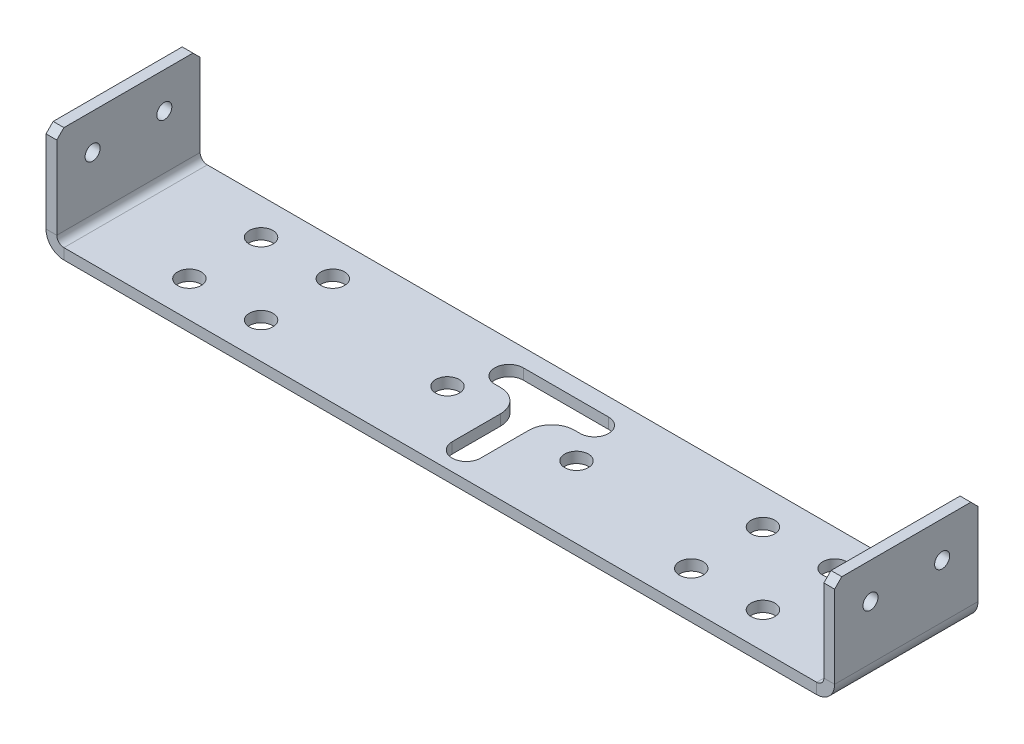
ISO-10303-21;
HEADER;
FILE_DESCRIPTION(('STEP AP214'),'2;1');
FILE_NAME('part.step','',(''),(''),'','','');
FILE_SCHEMA(('AUTOMOTIVE_DESIGN { 1 0 10303 214 1 1 1 1 }'));
ENDSEC;
DATA;
#1=APPLICATION_CONTEXT('core data for automotive mechanical design processes');
#2=APPLICATION_PROTOCOL_DEFINITION('international standard','automotive_design',2000,#1);
#3=PRODUCT_CONTEXT('',#1,'mechanical');
#4=PRODUCT('Part','Part','',(#3));
#5=PRODUCT_RELATED_PRODUCT_CATEGORY('part','',(#4));
#6=PRODUCT_DEFINITION_FORMATION('','',#4);
#7=PRODUCT_DEFINITION_CONTEXT('part definition',#1,'design');
#8=PRODUCT_DEFINITION('design','',#6,#7);
#9=PRODUCT_DEFINITION_SHAPE('','',#8);
#10=(LENGTH_UNIT() NAMED_UNIT(*) SI_UNIT(.MILLI.,.METRE.));
#11=(NAMED_UNIT(*) PLANE_ANGLE_UNIT() SI_UNIT($,.RADIAN.));
#12=(NAMED_UNIT(*) SI_UNIT($,.STERADIAN.) SOLID_ANGLE_UNIT());
#13=UNCERTAINTY_MEASURE_WITH_UNIT(LENGTH_MEASURE(1.E-05),#10,'distance_accuracy_value','');
#14=(GEOMETRIC_REPRESENTATION_CONTEXT(3) GLOBAL_UNCERTAINTY_ASSIGNED_CONTEXT((#13)) GLOBAL_UNIT_ASSIGNED_CONTEXT((#10,
#11,#12)) REPRESENTATION_CONTEXT('',''));
#15=CARTESIAN_POINT('',(0.,0.,0.));
#16=DIRECTION('',(0.,0.,1.));
#17=DIRECTION('',(1.,0.,0.));
#18=AXIS2_PLACEMENT_3D('',#15,#16,#17);
#19=CARTESIAN_POINT('',(-110.,5.,20.));
#20=DIRECTION('',(0.,0.,1.));
#21=DIRECTION('',(1.,0.,0.));
#22=AXIS2_PLACEMENT_3D('',#19,#20,#21);
#23=PLANE('',#22);
#24=DIRECTION('',(1.,0.,0.));
#25=VECTOR('',#24,1.);
#26=CARTESIAN_POINT('',(-110.,5.,20.));
#27=LINE('',#26,#25);
#28=CARTESIAN_POINT('',(-110.,5.,20.));
#29=VERTEX_POINT('',#28);
#30=CARTESIAN_POINT('',(-107.,5.,20.));
#31=VERTEX_POINT('',#30);
#32=EDGE_CURVE('E468',#29,#31,#27,.T.);
#33=ORIENTED_EDGE('',*,*,#32,.F.);
#34=CARTESIAN_POINT('',(-105.,5.,20.));
#35=DIRECTION('',(0.,0.,-1.));
#36=DIRECTION('',(-1.,0.,0.));
#37=AXIS2_PLACEMENT_3D('',#34,#35,#36);
#38=CIRCLE('',#37,5.);
#39=CARTESIAN_POINT('',(-105.,0.,20.));
#40=VERTEX_POINT('',#39);
#41=EDGE_CURVE('E382',#29,#40,#38,.F.);
#42=ORIENTED_EDGE('',*,*,#41,.T.);
#43=DIRECTION('',(0.,-1.,0.));
#44=VECTOR('',#43,1.);
#45=CARTESIAN_POINT('',(-105.,3.,20.));
#46=LINE('',#45,#44);
#47=CARTESIAN_POINT('',(-105.,3.,20.));
#48=VERTEX_POINT('',#47);
#49=EDGE_CURVE('E466',#48,#40,#46,.T.);
#50=ORIENTED_EDGE('',*,*,#49,.F.);
#51=CARTESIAN_POINT('',(-105.,5.,20.));
#52=DIRECTION('',(0.,0.,1.));
#53=DIRECTION('',(1.,0.,0.));
#54=AXIS2_PLACEMENT_3D('',#51,#52,#53);
#55=CIRCLE('',#54,2.);
#56=EDGE_CURVE('E375',#31,#48,#55,.T.);
#57=ORIENTED_EDGE('',*,*,#56,.F.);
#58=EDGE_LOOP('',(#33,#42,#50,#57));
#59=FACE_BOUND('',#58,.T.);
#60=ADVANCED_FACE('F42',(#59),#23,.T.);
#61=CARTESIAN_POINT('',(-105.,3.,20.));
#62=DIRECTION('',(0.,0.,1.));
#63=DIRECTION('',(1.,0.,0.));
#64=AXIS2_PLACEMENT_3D('',#61,#62,#63);
#65=PLANE('',#64);
#66=DIRECTION('',(0.,1.,0.));
#67=VECTOR('',#66,1.);
#68=CARTESIAN_POINT('',(-107.,30.,20.));
#69=LINE('',#68,#67);
#70=CARTESIAN_POINT('',(-107.,28.,20.));
#71=VERTEX_POINT('',#70);
#72=EDGE_CURVE('E378',#71,#31,#69,.F.);
#73=ORIENTED_EDGE('',*,*,#72,.F.);
#74=DIRECTION('',(-1.,0.,0.));
#75=VECTOR('',#74,1.);
#76=CARTESIAN_POINT('',(-105.,28.,20.));
#77=LINE('',#76,#75);
#78=CARTESIAN_POINT('',(-110.,28.,20.));
#79=VERTEX_POINT('',#78);
#80=EDGE_CURVE('E498',#71,#79,#77,.T.);
#81=ORIENTED_EDGE('',*,*,#80,.T.);
#82=DIRECTION('',(0.,-1.,0.));
#83=VECTOR('',#82,1.);
#84=CARTESIAN_POINT('',(-110.,30.,20.));
#85=LINE('',#84,#83);
#86=EDGE_CURVE('E380',#79,#29,#85,.T.);
#87=ORIENTED_EDGE('',*,*,#86,.T.);
#88=ORIENTED_EDGE('',*,*,#32,.T.);
#89=EDGE_LOOP('',(#73,#81,#87,#88));
#90=FACE_BOUND('',#89,.T.);
#91=ADVANCED_FACE('F559',(#90),#65,.T.);
#92=CARTESIAN_POINT('',(-105.,0.,-20.));
#93=DIRECTION('',(0.,0.,-1.));
#94=DIRECTION('',(-1.,0.,0.));
#95=AXIS2_PLACEMENT_3D('',#92,#93,#94);
#96=PLANE('',#95);
#97=DIRECTION('',(0.,1.,0.));
#98=VECTOR('',#97,1.);
#99=CARTESIAN_POINT('',(-105.,0.,-20.));
#100=LINE('',#99,#98);
#101=CARTESIAN_POINT('',(-105.,0.,-20.));
#102=VERTEX_POINT('',#101);
#103=CARTESIAN_POINT('',(-105.,3.,-20.));
#104=VERTEX_POINT('',#103);
#105=EDGE_CURVE('E464',#102,#104,#100,.T.);
#106=ORIENTED_EDGE('',*,*,#105,.F.);
#107=CARTESIAN_POINT('',(-105.,5.,-20.));
#108=DIRECTION('',(0.,0.,-1.));
#109=DIRECTION('',(-1.,0.,0.));
#110=AXIS2_PLACEMENT_3D('',#107,#108,#109);
#111=CIRCLE('',#110,5.);
#112=CARTESIAN_POINT('',(-110.,5.,-20.));
#113=VERTEX_POINT('',#112);
#114=EDGE_CURVE('E410',#113,#102,#111,.F.);
#115=ORIENTED_EDGE('',*,*,#114,.F.);
#116=DIRECTION('',(-1.,0.,0.));
#117=VECTOR('',#116,1.);
#118=CARTESIAN_POINT('',(-107.,5.,-20.));
#119=LINE('',#118,#117);
#120=CARTESIAN_POINT('',(-107.,5.,-20.));
#121=VERTEX_POINT('',#120);
#122=EDGE_CURVE('E461',#121,#113,#119,.T.);
#123=ORIENTED_EDGE('',*,*,#122,.F.);
#124=CARTESIAN_POINT('',(-105.,5.,-20.));
#125=DIRECTION('',(0.,0.,1.));
#126=DIRECTION('',(1.,0.,0.));
#127=AXIS2_PLACEMENT_3D('',#124,#125,#126);
#128=CIRCLE('',#127,2.);
#129=EDGE_CURVE('E403',#121,#104,#128,.T.);
#130=ORIENTED_EDGE('',*,*,#129,.T.);
#131=EDGE_LOOP('',(#106,#115,#123,#130));
#132=FACE_BOUND('',#131,.T.);
#133=ADVANCED_FACE('F565',(#132),#96,.T.);
#134=CARTESIAN_POINT('',(-107.,5.,-20.));
#135=DIRECTION('',(0.,0.,-1.));
#136=DIRECTION('',(-1.,0.,0.));
#137=AXIS2_PLACEMENT_3D('',#134,#135,#136);
#138=PLANE('',#137);
#139=DIRECTION('',(1.,0.,0.));
#140=VECTOR('',#139,1.);
#141=CARTESIAN_POINT('',(-110.,0.,-20.));
#142=LINE('',#141,#140);
#143=CARTESIAN_POINT('',(105.,0.,-20.));
#144=VERTEX_POINT('',#143);
#145=EDGE_CURVE('E413',#102,#144,#142,.T.);
#146=ORIENTED_EDGE('',*,*,#145,.F.);
#147=ORIENTED_EDGE('',*,*,#105,.T.);
#148=DIRECTION('',(1.,0.,0.));
#149=VECTOR('',#148,1.);
#150=CARTESIAN_POINT('',(-110.,3.,-20.));
#151=LINE('',#150,#149);
#152=CARTESIAN_POINT('',(105.,3.00000000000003,-20.));
#153=VERTEX_POINT('',#152);
#154=EDGE_CURVE('E400',#104,#153,#151,.T.);
#155=ORIENTED_EDGE('',*,*,#154,.T.);
#156=DIRECTION('',(0.,-1.,0.));
#157=VECTOR('',#156,1.);
#158=CARTESIAN_POINT('',(105.,3.00000000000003,-20.));
#159=LINE('',#158,#157);
#160=EDGE_CURVE('E453',#153,#144,#159,.T.);
#161=ORIENTED_EDGE('',*,*,#160,.T.);
#162=EDGE_LOOP('',(#146,#147,#155,#161));
#163=FACE_BOUND('',#162,.T.);
#164=ADVANCED_FACE('F615',(#163),#138,.T.);
#165=CARTESIAN_POINT('',(105.,0.,20.));
#166=DIRECTION('',(0.,0.,1.));
#167=DIRECTION('',(1.,0.,0.));
#168=AXIS2_PLACEMENT_3D('',#165,#166,#167);
#169=PLANE('',#168);
#170=DIRECTION('',(0.,1.,0.));
#171=VECTOR('',#170,1.);
#172=CARTESIAN_POINT('',(105.,0.,20.));
#173=LINE('',#172,#171);
#174=CARTESIAN_POINT('',(105.,0.,20.));
#175=VERTEX_POINT('',#174);
#176=CARTESIAN_POINT('',(105.,3.00000000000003,20.));
#177=VERTEX_POINT('',#176);
#178=EDGE_CURVE('E459',#175,#177,#173,.T.);
#179=ORIENTED_EDGE('',*,*,#178,.F.);
#180=CARTESIAN_POINT('',(105.,5.00000000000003,20.));
#181=DIRECTION('',(0.,0.,-1.));
#182=DIRECTION('',(-1.,0.,0.));
#183=AXIS2_PLACEMENT_3D('',#180,#181,#182);
#184=CIRCLE('',#183,5.);
#185=CARTESIAN_POINT('',(110.,5.00000000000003,20.));
#186=VERTEX_POINT('',#185);
#187=EDGE_CURVE('E388',#175,#186,#184,.F.);
#188=ORIENTED_EDGE('',*,*,#187,.T.);
#189=DIRECTION('',(1.,0.,0.));
#190=VECTOR('',#189,1.);
#191=CARTESIAN_POINT('',(107.,5.00000000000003,20.));
#192=LINE('',#191,#190);
#193=CARTESIAN_POINT('',(107.,5.00000000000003,20.));
#194=VERTEX_POINT('',#193);
#195=EDGE_CURVE('E457',#194,#186,#192,.T.);
#196=ORIENTED_EDGE('',*,*,#195,.F.);
#197=CARTESIAN_POINT('',(105.,5.00000000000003,20.));
#198=DIRECTION('',(0.,0.,1.));
#199=DIRECTION('',(1.,0.,0.));
#200=AXIS2_PLACEMENT_3D('',#197,#198,#199);
#201=CIRCLE('',#200,2.);
#202=EDGE_CURVE('E369',#177,#194,#201,.T.);
#203=ORIENTED_EDGE('',*,*,#202,.F.);
#204=EDGE_LOOP('',(#179,#188,#196,#203));
#205=FACE_BOUND('',#204,.T.);
#206=ADVANCED_FACE('F643',(#205),#169,.T.);
#207=CARTESIAN_POINT('',(107.,5.00000000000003,20.));
#208=DIRECTION('',(0.,0.,1.));
#209=DIRECTION('',(1.,0.,0.));
#210=AXIS2_PLACEMENT_3D('',#207,#208,#209);
#211=PLANE('',#210);
#212=DIRECTION('',(1.,0.,0.));
#213=VECTOR('',#212,1.);
#214=CARTESIAN_POINT('',(-110.,0.,20.));
#215=LINE('',#214,#213);
#216=EDGE_CURVE('E385',#40,#175,#215,.T.);
#217=ORIENTED_EDGE('',*,*,#216,.T.);
#218=ORIENTED_EDGE('',*,*,#178,.T.);
#219=DIRECTION('',(1.,0.,0.));
#220=VECTOR('',#219,1.);
#221=CARTESIAN_POINT('',(-110.,3.,20.));
#222=LINE('',#221,#220);
#223=EDGE_CURVE('E372',#48,#177,#222,.T.);
#224=ORIENTED_EDGE('',*,*,#223,.F.);
#225=ORIENTED_EDGE('',*,*,#49,.T.);
#226=EDGE_LOOP('',(#217,#218,#224,#225));
#227=FACE_BOUND('',#226,.T.);
#228=ADVANCED_FACE('F645',(#227),#211,.T.);
#229=CARTESIAN_POINT('',(110.,5.00000000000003,-20.));
#230=DIRECTION('',(0.,0.,-1.));
#231=DIRECTION('',(-1.,0.,0.));
#232=AXIS2_PLACEMENT_3D('',#229,#230,#231);
#233=PLANE('',#232);
#234=DIRECTION('',(-1.,0.,0.));
#235=VECTOR('',#234,1.);
#236=CARTESIAN_POINT('',(110.,5.00000000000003,-20.));
#237=LINE('',#236,#235);
#238=CARTESIAN_POINT('',(110.,5.00000000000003,-20.));
#239=VERTEX_POINT('',#238);
#240=CARTESIAN_POINT('',(107.,5.00000000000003,-20.));
#241=VERTEX_POINT('',#240);
#242=EDGE_CURVE('E455',#239,#241,#237,.T.);
#243=ORIENTED_EDGE('',*,*,#242,.F.);
#244=CARTESIAN_POINT('',(105.,5.00000000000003,-20.));
#245=DIRECTION('',(0.,0.,-1.));
#246=DIRECTION('',(-1.,0.,0.));
#247=AXIS2_PLACEMENT_3D('',#244,#245,#246);
#248=CIRCLE('',#247,5.);
#249=EDGE_CURVE('E366',#144,#239,#248,.F.);
#250=ORIENTED_EDGE('',*,*,#249,.F.);
#251=ORIENTED_EDGE('',*,*,#160,.F.);
#252=CARTESIAN_POINT('',(105.,5.00000000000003,-20.));
#253=DIRECTION('',(0.,0.,1.));
#254=DIRECTION('',(1.,0.,0.));
#255=AXIS2_PLACEMENT_3D('',#252,#253,#254);
#256=CIRCLE('',#255,2.);
#257=EDGE_CURVE('E397',#153,#241,#256,.T.);
#258=ORIENTED_EDGE('',*,*,#257,.T.);
#259=EDGE_LOOP('',(#243,#250,#251,#258));
#260=FACE_BOUND('',#259,.T.);
#261=ADVANCED_FACE('F632',(#260),#233,.T.);
#262=CARTESIAN_POINT('',(105.,3.00000000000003,-20.));
#263=DIRECTION('',(0.,0.,-1.));
#264=DIRECTION('',(-1.,0.,0.));
#265=AXIS2_PLACEMENT_3D('',#262,#263,#264);
#266=PLANE('',#265);
#267=DIRECTION('',(0.,1.,0.));
#268=VECTOR('',#267,1.);
#269=CARTESIAN_POINT('',(107.,0.,-20.));
#270=LINE('',#269,#268);
#271=CARTESIAN_POINT('',(107.,28.,-20.));
#272=VERTEX_POINT('',#271);
#273=EDGE_CURVE('E394',#241,#272,#270,.T.);
#274=ORIENTED_EDGE('',*,*,#273,.T.);
#275=DIRECTION('',(1.,0.,0.));
#276=VECTOR('',#275,1.);
#277=CARTESIAN_POINT('',(105.,28.,-20.));
#278=LINE('',#277,#276);
#279=CARTESIAN_POINT('',(110.,28.,-20.));
#280=VERTEX_POINT('',#279);
#281=EDGE_CURVE('E486',#272,#280,#278,.T.);
#282=ORIENTED_EDGE('',*,*,#281,.T.);
#283=DIRECTION('',(0.,1.,0.));
#284=VECTOR('',#283,1.);
#285=CARTESIAN_POINT('',(110.,0.,-20.));
#286=LINE('',#285,#284);
#287=EDGE_CURVE('E361',#239,#280,#286,.T.);
#288=ORIENTED_EDGE('',*,*,#287,.F.);
#289=ORIENTED_EDGE('',*,*,#242,.T.);
#290=EDGE_LOOP('',(#274,#282,#288,#289));
#291=FACE_BOUND('',#290,.T.);
#292=ADVANCED_FACE('F684',(#291),#266,.T.);
#293=CARTESIAN_POINT('',(110.,0.,20.));
#294=DIRECTION('',(-1.,0.,0.));
#295=DIRECTION('',(0.,-1.,0.));
#296=AXIS2_PLACEMENT_3D('',#293,#294,#295);
#297=PLANE('',#296);
#298=CARTESIAN_POINT('',(110.,20.,-10.));
#299=DIRECTION('',(-1.,0.,0.));
#300=DIRECTION('',(0.,-1.,0.));
#301=AXIS2_PLACEMENT_3D('',#298,#299,#300);
#302=CIRCLE('',#301,2.1);
#303=CARTESIAN_POINT('',(110.,17.9,-10.));
#304=VERTEX_POINT('',#303);
#305=EDGE_CURVE('E354',#304,#304,#302,.T.);
#306=ORIENTED_EDGE('',*,*,#305,.T.);
#307=EDGE_LOOP('',(#306));
#308=FACE_BOUND('',#307,.T.);
#309=CARTESIAN_POINT('',(110.,20.,10.));
#310=DIRECTION('',(-1.,0.,0.));
#311=DIRECTION('',(0.,-1.,0.));
#312=AXIS2_PLACEMENT_3D('',#309,#310,#311);
#313=CIRCLE('',#312,2.1);
#314=CARTESIAN_POINT('',(110.,17.9,10.));
#315=VERTEX_POINT('',#314);
#316=EDGE_CURVE('E358',#315,#315,#313,.T.);
#317=ORIENTED_EDGE('',*,*,#316,.T.);
#318=EDGE_LOOP('',(#317));
#319=FACE_BOUND('',#318,.T.);
#320=DIRECTION('',(0.,0.,-1.));
#321=VECTOR('',#320,1.);
#322=CARTESIAN_POINT('',(110.,30.,20.));
#323=LINE('',#322,#321);
#324=CARTESIAN_POINT('',(110.,30.,18.));
#325=VERTEX_POINT('',#324);
#326=CARTESIAN_POINT('',(110.,30.,-18.));
#327=VERTEX_POINT('',#326);
#328=EDGE_CURVE('E450',#325,#327,#323,.T.);
#329=ORIENTED_EDGE('',*,*,#328,.F.);
#330=DIRECTION('',(0.,0.707106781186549,-0.707106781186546));
#331=VECTOR('',#330,1.);
#332=CARTESIAN_POINT('',(110.,30.,18.));
#333=LINE('',#332,#331);
#334=CARTESIAN_POINT('',(110.,28.,20.));
#335=VERTEX_POINT('',#334);
#336=EDGE_CURVE('E478',#325,#335,#333,.F.);
#337=ORIENTED_EDGE('',*,*,#336,.T.);
#338=DIRECTION('',(0.,1.,0.));
#339=VECTOR('',#338,1.);
#340=CARTESIAN_POINT('',(110.,0.,20.));
#341=LINE('',#340,#339);
#342=EDGE_CURVE('E362',#186,#335,#341,.T.);
#343=ORIENTED_EDGE('',*,*,#342,.F.);
#344=DIRECTION('',(0.,0.,-1.));
#345=VECTOR('',#344,1.);
#346=CARTESIAN_POINT('',(110.,5.00000000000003,20.));
#347=LINE('',#346,#345);
#348=EDGE_CURVE('E391',#186,#239,#347,.T.);
#349=ORIENTED_EDGE('',*,*,#348,.T.);
#350=ORIENTED_EDGE('',*,*,#287,.T.);
#351=DIRECTION('',(0.,-0.707106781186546,-0.707106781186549));
#352=VECTOR('',#351,1.);
#353=CARTESIAN_POINT('',(110.,28.,-20.));
#354=LINE('',#353,#352);
#355=EDGE_CURVE('E476',#280,#327,#354,.F.);
#356=ORIENTED_EDGE('',*,*,#355,.T.);
#357=EDGE_LOOP('',(#329,#337,#343,#349,#350,#356));
#358=FACE_BOUND('',#357,.T.);
#359=ADVANCED_FACE('F680',(#308,#319,#358),#297,.F.);
#360=CARTESIAN_POINT('',(107.,30.,20.));
#361=DIRECTION('',(0.,1.,0.));
#362=DIRECTION('',(-1.,0.,0.));
#363=AXIS2_PLACEMENT_3D('',#360,#361,#362);
#364=PLANE('',#363);
#365=DIRECTION('',(0.,0.,-1.));
#366=VECTOR('',#365,1.);
#367=CARTESIAN_POINT('',(107.,30.,20.));
#368=LINE('',#367,#366);
#369=CARTESIAN_POINT('',(107.,30.,18.));
#370=VERTEX_POINT('',#369);
#371=CARTESIAN_POINT('',(107.,30.,-18.));
#372=VERTEX_POINT('',#371);
#373=EDGE_CURVE('E447',#370,#372,#368,.T.);
#374=ORIENTED_EDGE('',*,*,#373,.F.);
#375=DIRECTION('',(1.,0.,0.));
#376=VECTOR('',#375,1.);
#377=CARTESIAN_POINT('',(107.,30.,18.));
#378=LINE('',#377,#376);
#379=EDGE_CURVE('E473',#370,#325,#378,.T.);
#380=ORIENTED_EDGE('',*,*,#379,.T.);
#381=ORIENTED_EDGE('',*,*,#328,.T.);
#382=DIRECTION('',(-1.,0.,0.));
#383=VECTOR('',#382,1.);
#384=CARTESIAN_POINT('',(107.,30.,-18.));
#385=LINE('',#384,#383);
#386=EDGE_CURVE('E471',#327,#372,#385,.T.);
#387=ORIENTED_EDGE('',*,*,#386,.T.);
#388=EDGE_LOOP('',(#374,#380,#381,#387));
#389=FACE_BOUND('',#388,.T.);
#390=ADVANCED_FACE('F676',(#389),#364,.T.);
#391=CARTESIAN_POINT('',(107.,0.,20.));
#392=DIRECTION('',(-1.,0.,0.));
#393=DIRECTION('',(0.,-1.,0.));
#394=AXIS2_PLACEMENT_3D('',#391,#392,#393);
#395=PLANE('',#394);
#396=CARTESIAN_POINT('',(107.,20.,-10.));
#397=DIRECTION('',(-1.,0.,0.));
#398=DIRECTION('',(0.,0.,1.));
#399=AXIS2_PLACEMENT_3D('',#396,#397,#398);
#400=CIRCLE('',#399,2.1);
#401=CARTESIAN_POINT('',(107.,20.,-7.9));
#402=VERTEX_POINT('',#401);
#403=EDGE_CURVE('E351',#402,#402,#400,.T.);
#404=ORIENTED_EDGE('',*,*,#403,.F.);
#405=EDGE_LOOP('',(#404));
#406=FACE_BOUND('',#405,.T.);
#407=CARTESIAN_POINT('',(107.,20.,10.));
#408=DIRECTION('',(-1.,0.,0.));
#409=DIRECTION('',(0.,0.,1.));
#410=AXIS2_PLACEMENT_3D('',#407,#408,#409);
#411=CIRCLE('',#410,2.1);
#412=CARTESIAN_POINT('',(107.,20.,12.1));
#413=VERTEX_POINT('',#412);
#414=EDGE_CURVE('E355',#413,#413,#411,.T.);
#415=ORIENTED_EDGE('',*,*,#414,.F.);
#416=EDGE_LOOP('',(#415));
#417=FACE_BOUND('',#416,.T.);
#418=DIRECTION('',(0.,1.,0.));
#419=VECTOR('',#418,1.);
#420=CARTESIAN_POINT('',(107.,0.,20.));
#421=LINE('',#420,#419);
#422=CARTESIAN_POINT('',(107.,28.,20.));
#423=VERTEX_POINT('',#422);
#424=EDGE_CURVE('E365',#194,#423,#421,.T.);
#425=ORIENTED_EDGE('',*,*,#424,.T.);
#426=DIRECTION('',(0.,-0.707106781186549,0.707106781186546));
#427=VECTOR('',#426,1.);
#428=CARTESIAN_POINT('',(107.,14.,34.));
#429=LINE('',#428,#427);
#430=EDGE_CURVE('E484',#423,#370,#429,.F.);
#431=ORIENTED_EDGE('',*,*,#430,.T.);
#432=ORIENTED_EDGE('',*,*,#373,.T.);
#433=DIRECTION('',(0.,0.707106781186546,0.707106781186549));
#434=VECTOR('',#433,1.);
#435=CARTESIAN_POINT('',(107.,34.0000000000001,-13.9999999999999));
#436=LINE('',#435,#434);
#437=EDGE_CURVE('E482',#372,#272,#436,.F.);
#438=ORIENTED_EDGE('',*,*,#437,.T.);
#439=ORIENTED_EDGE('',*,*,#273,.F.);
#440=DIRECTION('',(0.,0.,-1.));
#441=VECTOR('',#440,1.);
#442=CARTESIAN_POINT('',(107.,5.00000000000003,20.));
#443=LINE('',#442,#441);
#444=EDGE_CURVE('E444',#194,#241,#443,.T.);
#445=ORIENTED_EDGE('',*,*,#444,.F.);
#446=EDGE_LOOP('',(#425,#431,#432,#438,#439,#445));
#447=FACE_BOUND('',#446,.T.);
#448=ADVANCED_FACE('F673',(#406,#417,#447),#395,.T.);
#449=CARTESIAN_POINT('',(105.,5.00000000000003,20.));
#450=DIRECTION('',(0.,0.,-1.));
#451=DIRECTION('',(-1.,0.,0.));
#452=AXIS2_PLACEMENT_3D('',#449,#450,#451);
#453=CYLINDRICAL_SURFACE('',#452,2.);
#454=ORIENTED_EDGE('',*,*,#257,.F.);
#455=DIRECTION('',(0.,0.,-1.));
#456=VECTOR('',#455,1.);
#457=CARTESIAN_POINT('',(105.,3.00000000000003,20.));
#458=LINE('',#457,#456);
#459=EDGE_CURVE('E441',#177,#153,#458,.T.);
#460=ORIENTED_EDGE('',*,*,#459,.F.);
#461=ORIENTED_EDGE('',*,*,#202,.T.);
#462=ORIENTED_EDGE('',*,*,#444,.T.);
#463=EDGE_LOOP('',(#454,#460,#461,#462));
#464=FACE_BOUND('',#463,.T.);
#465=ADVANCED_FACE('F628',(#464),#453,.F.);
#466=CARTESIAN_POINT('',(-110.,3.,20.));
#467=DIRECTION('',(0.,1.,0.));
#468=DIRECTION('',(-1.,0.,0.));
#469=AXIS2_PLACEMENT_3D('',#466,#467,#468);
#470=PLANE('',#469);
#471=DIRECTION('',(0.,0.,1.));
#472=VECTOR('',#471,1.);
#473=CARTESIAN_POINT('',(-3.96875,3.00000000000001,-7.11359022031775));
#474=LINE('',#473,#472);
#475=CARTESIAN_POINT('',(-3.96875,3.00000000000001,-0.763590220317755));
#476=VERTEX_POINT('',#475);
#477=CARTESIAN_POINT('',(-3.96874999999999,3.00000000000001,12.7301597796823));
#478=VERTEX_POINT('',#477);
#479=EDGE_CURVE('E254',#476,#478,#474,.T.);
#480=ORIENTED_EDGE('',*,*,#479,.F.);
#481=CARTESIAN_POINT('',(-10.31875,3.00000000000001,-0.763590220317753));
#482=DIRECTION('',(0.,1.,0.));
#483=DIRECTION('',(-1.,0.,0.));
#484=AXIS2_PLACEMENT_3D('',#481,#482,#483);
#485=CIRCLE('',#484,6.35);
#486=CARTESIAN_POINT('',(-10.31875,3.00000000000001,-7.11359022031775));
#487=VERTEX_POINT('',#486);
#488=EDGE_CURVE('E514',#476,#487,#485,.T.);
#489=ORIENTED_EDGE('',*,*,#488,.T.);
#490=DIRECTION('',(1.,0.,0.));
#491=VECTOR('',#490,1.);
#492=CARTESIAN_POINT('',(-11.90625,3.00000000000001,-7.11359022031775));
#493=LINE('',#492,#491);
#494=CARTESIAN_POINT('',(-11.90625,3.00000000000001,-7.11359022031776));
#495=VERTEX_POINT('',#494);
#496=EDGE_CURVE('E251',#495,#487,#493,.T.);
#497=ORIENTED_EDGE('',*,*,#496,.F.);
#498=CARTESIAN_POINT('',(-11.90625,3.00000000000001,-11.0823402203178));
#499=DIRECTION('',(0.,1.,0.));
#500=DIRECTION('',(-1.,0.,0.));
#501=AXIS2_PLACEMENT_3D('',#498,#499,#500);
#502=CIRCLE('',#501,3.96875);
#503=CARTESIAN_POINT('',(-11.90625,3.00000000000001,-15.0510902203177));
#504=VERTEX_POINT('',#503);
#505=EDGE_CURVE('E267',#504,#495,#502,.T.);
#506=ORIENTED_EDGE('',*,*,#505,.F.);
#507=DIRECTION('',(-1.,0.,0.));
#508=VECTOR('',#507,1.);
#509=CARTESIAN_POINT('',(11.90625,3.00000000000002,-15.0510902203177));
#510=LINE('',#509,#508);
#511=CARTESIAN_POINT('',(11.90625,3.00000000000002,-15.0510902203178));
#512=VERTEX_POINT('',#511);
#513=EDGE_CURVE('E264',#512,#504,#510,.T.);
#514=ORIENTED_EDGE('',*,*,#513,.F.);
#515=CARTESIAN_POINT('',(11.90625,3.00000000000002,-11.0823402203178));
#516=DIRECTION('',(0.,-1.,0.));
#517=DIRECTION('',(1.,0.,0.));
#518=AXIS2_PLACEMENT_3D('',#515,#516,#517);
#519=CIRCLE('',#518,3.96875);
#520=CARTESIAN_POINT('',(11.90625,3.00000000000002,-7.11359022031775));
#521=VERTEX_POINT('',#520);
#522=EDGE_CURVE('E261',#512,#521,#519,.T.);
#523=ORIENTED_EDGE('',*,*,#522,.T.);
#524=DIRECTION('',(1.,0.,0.));
#525=VECTOR('',#524,1.);
#526=CARTESIAN_POINT('',(3.96874999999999,3.00000000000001,-7.11359022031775));
#527=LINE('',#526,#525);
#528=CARTESIAN_POINT('',(10.31875,3.00000000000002,-7.11359022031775));
#529=VERTEX_POINT('',#528);
#530=EDGE_CURVE('E259',#529,#521,#527,.T.);
#531=ORIENTED_EDGE('',*,*,#530,.F.);
#532=CARTESIAN_POINT('',(10.31875,3.00000000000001,-0.763590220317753));
#533=DIRECTION('',(0.,1.,0.));
#534=DIRECTION('',(-1.,0.,0.));
#535=AXIS2_PLACEMENT_3D('',#532,#533,#534);
#536=CIRCLE('',#535,6.35);
#537=CARTESIAN_POINT('',(3.96875,3.00000000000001,-0.763590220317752));
#538=VERTEX_POINT('',#537);
#539=EDGE_CURVE('E512',#529,#538,#536,.T.);
#540=ORIENTED_EDGE('',*,*,#539,.T.);
#541=DIRECTION('',(0.,0.,1.));
#542=VECTOR('',#541,1.);
#543=CARTESIAN_POINT('',(3.96874999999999,3.00000000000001,-7.11359022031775));
#544=LINE('',#543,#542);
#545=CARTESIAN_POINT('',(3.96875,3.00000000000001,12.7301597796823));
#546=VERTEX_POINT('',#545);
#547=EDGE_CURVE('E257',#538,#546,#544,.T.);
#548=ORIENTED_EDGE('',*,*,#547,.T.);
#549=CARTESIAN_POINT('',(0.,3.00000000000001,12.7301597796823));
#550=DIRECTION('',(0.,1.,0.));
#551=DIRECTION('',(-1.,0.,0.));
#552=AXIS2_PLACEMENT_3D('',#549,#550,#551);
#553=CIRCLE('',#552,3.96875);
#554=EDGE_CURVE('E227',#478,#546,#553,.T.);
#555=ORIENTED_EDGE('',*,*,#554,.F.);
#556=EDGE_LOOP('',(#480,#489,#497,#506,#514,#523,#531,#540,#548,#555));
#557=FACE_BOUND('',#556,.T.);
#558=CARTESIAN_POINT('',(80.,3.00000000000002,10.));
#559=DIRECTION('',(0.,1.,0.));
#560=DIRECTION('',(0.,0.,1.));
#561=AXIS2_PLACEMENT_3D('',#558,#559,#560);
#562=CIRCLE('',#561,3.29999999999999);
#563=CARTESIAN_POINT('',(80.,3.00000000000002,13.3));
#564=VERTEX_POINT('',#563);
#565=EDGE_CURVE('E272',#564,#564,#562,.T.);
#566=ORIENTED_EDGE('',*,*,#565,.F.);
#567=EDGE_LOOP('',(#566));
#568=FACE_BOUND('',#567,.T.);
#569=CARTESIAN_POINT('',(60.,3.00000000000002,-10.));
#570=DIRECTION('',(0.,1.,0.));
#571=DIRECTION('',(0.,0.,1.));
#572=AXIS2_PLACEMENT_3D('',#569,#570,#571);
#573=CIRCLE('',#572,3.29999999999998);
#574=CARTESIAN_POINT('',(60.,3.00000000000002,-6.70000000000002));
#575=VERTEX_POINT('',#574);
#576=EDGE_CURVE('E285',#575,#575,#573,.T.);
#577=ORIENTED_EDGE('',*,*,#576,.F.);
#578=EDGE_LOOP('',(#577));
#579=FACE_BOUND('',#578,.T.);
#580=CARTESIAN_POINT('',(80.,3.00000000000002,-10.));
#581=DIRECTION('',(0.,1.,0.));
#582=DIRECTION('',(0.,0.,1.));
#583=AXIS2_PLACEMENT_3D('',#580,#581,#582);
#584=CIRCLE('',#583,3.29999999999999);
#585=CARTESIAN_POINT('',(80.,3.00000000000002,-6.70000000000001));
#586=VERTEX_POINT('',#585);
#587=EDGE_CURVE('E291',#586,#586,#584,.T.);
#588=ORIENTED_EDGE('',*,*,#587,.F.);
#589=EDGE_LOOP('',(#588));
#590=FACE_BOUND('',#589,.T.);
#591=CARTESIAN_POINT('',(60.,3.00000000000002,10.));
#592=DIRECTION('',(0.,1.,0.));
#593=DIRECTION('',(0.,0.,1.));
#594=AXIS2_PLACEMENT_3D('',#591,#592,#593);
#595=CIRCLE('',#594,3.29999999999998);
#596=CARTESIAN_POINT('',(60.,3.00000000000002,13.3));
#597=VERTEX_POINT('',#596);
#598=EDGE_CURVE('E297',#597,#597,#595,.T.);
#599=ORIENTED_EDGE('',*,*,#598,.F.);
#600=EDGE_LOOP('',(#599));
#601=FACE_BOUND('',#600,.T.);
#602=CARTESIAN_POINT('',(-80.,3.,10.));
#603=DIRECTION('',(0.,1.,0.));
#604=DIRECTION('',(0.,0.,1.));
#605=AXIS2_PLACEMENT_3D('',#602,#603,#604);
#606=CIRCLE('',#605,3.29999999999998);
#607=CARTESIAN_POINT('',(-80.,3.,13.3));
#608=VERTEX_POINT('',#607);
#609=EDGE_CURVE('E303',#608,#608,#606,.T.);
#610=ORIENTED_EDGE('',*,*,#609,.F.);
#611=EDGE_LOOP('',(#610));
#612=FACE_BOUND('',#611,.T.);
#613=CARTESIAN_POINT('',(-60.,3.00000000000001,10.));
#614=DIRECTION('',(0.,1.,0.));
#615=DIRECTION('',(0.,0.,1.));
#616=AXIS2_PLACEMENT_3D('',#613,#614,#615);
#617=CIRCLE('',#616,3.29999999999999);
#618=CARTESIAN_POINT('',(-60.,3.00000000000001,13.3));
#619=VERTEX_POINT('',#618);
#620=EDGE_CURVE('E309',#619,#619,#617,.T.);
#621=ORIENTED_EDGE('',*,*,#620,.F.);
#622=EDGE_LOOP('',(#621));
#623=FACE_BOUND('',#622,.T.);
#624=CARTESIAN_POINT('',(-80.,3.,-10.));
#625=DIRECTION('',(0.,1.,0.));
#626=DIRECTION('',(0.,0.,1.));
#627=AXIS2_PLACEMENT_3D('',#624,#625,#626);
#628=CIRCLE('',#627,3.29999999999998);
#629=CARTESIAN_POINT('',(-80.,3.,-6.70000000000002));
#630=VERTEX_POINT('',#629);
#631=EDGE_CURVE('E315',#630,#630,#628,.T.);
#632=ORIENTED_EDGE('',*,*,#631,.F.);
#633=EDGE_LOOP('',(#632));
#634=FACE_BOUND('',#633,.T.);
#635=CARTESIAN_POINT('',(-60.,3.00000000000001,-10.));
#636=DIRECTION('',(0.,1.,0.));
#637=DIRECTION('',(0.,0.,1.));
#638=AXIS2_PLACEMENT_3D('',#635,#636,#637);
#639=CIRCLE('',#638,3.29999999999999);
#640=CARTESIAN_POINT('',(-60.,3.00000000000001,-6.70000000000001));
#641=VERTEX_POINT('',#640);
#642=EDGE_CURVE('E321',#641,#641,#639,.T.);
#643=ORIENTED_EDGE('',*,*,#642,.F.);
#644=EDGE_LOOP('',(#643));
#645=FACE_BOUND('',#644,.T.);
#646=CARTESIAN_POINT('',(18.,3.00000000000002,0.));
#647=DIRECTION('',(0.,1.,0.));
#648=DIRECTION('',(-1.,0.,0.));
#649=AXIS2_PLACEMENT_3D('',#646,#647,#648);
#650=CIRCLE('',#649,3.29999999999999);
#651=CARTESIAN_POINT('',(14.7,3.00000000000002,0.));
#652=VERTEX_POINT('',#651);
#653=EDGE_CURVE('E330',#652,#652,#650,.T.);
#654=ORIENTED_EDGE('',*,*,#653,.F.);
#655=EDGE_LOOP('',(#654));
#656=FACE_BOUND('',#655,.T.);
#657=CARTESIAN_POINT('',(-18.,3.00000000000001,0.));
#658=DIRECTION('',(0.,1.,0.));
#659=DIRECTION('',(-1.,0.,0.));
#660=AXIS2_PLACEMENT_3D('',#657,#658,#659);
#661=CIRCLE('',#660,3.29999999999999);
#662=CARTESIAN_POINT('',(-21.3,3.00000000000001,0.));
#663=VERTEX_POINT('',#662);
#664=EDGE_CURVE('E336',#663,#663,#661,.T.);
#665=ORIENTED_EDGE('',*,*,#664,.F.);
#666=EDGE_LOOP('',(#665));
#667=FACE_BOUND('',#666,.T.);
#668=ORIENTED_EDGE('',*,*,#154,.F.);
#669=DIRECTION('',(0.,0.,-1.));
#670=VECTOR('',#669,1.);
#671=CARTESIAN_POINT('',(-105.,3.,20.));
#672=LINE('',#671,#670);
#673=EDGE_CURVE('E438',#48,#104,#672,.T.);
#674=ORIENTED_EDGE('',*,*,#673,.F.);
#675=ORIENTED_EDGE('',*,*,#223,.T.);
#676=ORIENTED_EDGE('',*,*,#459,.T.);
#677=EDGE_LOOP('',(#668,#674,#675,#676));
#678=FACE_BOUND('',#677,.T.);
#679=ADVANCED_FACE('F529',(#557,#568,#579,#590,#601,#612,#623,#634,#645,#656,#667,#678),#470,.T.);
#680=CARTESIAN_POINT('',(-105.,5.,20.));
#681=DIRECTION('',(0.,0.,-1.));
#682=DIRECTION('',(-1.,0.,0.));
#683=AXIS2_PLACEMENT_3D('',#680,#681,#682);
#684=CYLINDRICAL_SURFACE('',#683,2.);
#685=ORIENTED_EDGE('',*,*,#129,.F.);
#686=DIRECTION('',(0.,0.,-1.));
#687=VECTOR('',#686,1.);
#688=CARTESIAN_POINT('',(-107.,5.,20.));
#689=LINE('',#688,#687);
#690=EDGE_CURVE('E435',#31,#121,#689,.T.);
#691=ORIENTED_EDGE('',*,*,#690,.F.);
#692=ORIENTED_EDGE('',*,*,#56,.T.);
#693=ORIENTED_EDGE('',*,*,#673,.T.);
#694=EDGE_LOOP('',(#685,#691,#692,#693));
#695=FACE_BOUND('',#694,.T.);
#696=ADVANCED_FACE('F619',(#695),#684,.F.);
#697=CARTESIAN_POINT('',(-107.,30.,20.));
#698=DIRECTION('',(1.,0.,0.));
#699=DIRECTION('',(0.,0.,-1.));
#700=AXIS2_PLACEMENT_3D('',#697,#698,#699);
#701=PLANE('',#700);
#702=CARTESIAN_POINT('',(-107.,20.,10.));
#703=DIRECTION('',(1.,0.,0.));
#704=DIRECTION('',(0.,0.,-1.));
#705=AXIS2_PLACEMENT_3D('',#702,#703,#704);
#706=CIRCLE('',#705,2.1);
#707=CARTESIAN_POINT('',(-107.,20.,7.9));
#708=VERTEX_POINT('',#707);
#709=EDGE_CURVE('E339',#708,#708,#706,.T.);
#710=ORIENTED_EDGE('',*,*,#709,.F.);
#711=EDGE_LOOP('',(#710));
#712=FACE_BOUND('',#711,.T.);
#713=CARTESIAN_POINT('',(-107.,20.,-10.));
#714=DIRECTION('',(1.,0.,0.));
#715=DIRECTION('',(0.,0.,-1.));
#716=AXIS2_PLACEMENT_3D('',#713,#714,#715);
#717=CIRCLE('',#716,2.1);
#718=CARTESIAN_POINT('',(-107.,20.,-12.1));
#719=VERTEX_POINT('',#718);
#720=EDGE_CURVE('E345',#719,#719,#717,.T.);
#721=ORIENTED_EDGE('',*,*,#720,.F.);
#722=EDGE_LOOP('',(#721));
#723=FACE_BOUND('',#722,.T.);
#724=DIRECTION('',(0.,0.,-1.));
#725=VECTOR('',#724,1.);
#726=CARTESIAN_POINT('',(-107.,30.,20.));
#727=LINE('',#726,#725);
#728=CARTESIAN_POINT('',(-107.,30.,18.));
#729=VERTEX_POINT('',#728);
#730=CARTESIAN_POINT('',(-107.,30.,-18.));
#731=VERTEX_POINT('',#730);
#732=EDGE_CURVE('E432',#729,#731,#727,.T.);
#733=ORIENTED_EDGE('',*,*,#732,.F.);
#734=DIRECTION('',(0.,0.707106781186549,-0.707106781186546));
#735=VECTOR('',#734,1.);
#736=CARTESIAN_POINT('',(-107.,29.,19.));
#737=LINE('',#736,#735);
#738=EDGE_CURVE('E496',#729,#71,#737,.F.);
#739=ORIENTED_EDGE('',*,*,#738,.T.);
#740=ORIENTED_EDGE('',*,*,#72,.T.);
#741=ORIENTED_EDGE('',*,*,#690,.T.);
#742=DIRECTION('',(0.,1.,0.));
#743=VECTOR('',#742,1.);
#744=CARTESIAN_POINT('',(-107.,30.,-20.));
#745=LINE('',#744,#743);
#746=CARTESIAN_POINT('',(-107.,28.,-20.));
#747=VERTEX_POINT('',#746);
#748=EDGE_CURVE('E406',#747,#121,#745,.F.);
#749=ORIENTED_EDGE('',*,*,#748,.F.);
#750=DIRECTION('',(0.,0.707106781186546,0.707106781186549));
#751=VECTOR('',#750,1.);
#752=CARTESIAN_POINT('',(-107.,49.,1.0000000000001));
#753=LINE('',#752,#751);
#754=EDGE_CURVE('E494',#747,#731,#753,.T.);
#755=ORIENTED_EDGE('',*,*,#754,.T.);
#756=EDGE_LOOP('',(#733,#739,#740,#741,#749,#755));
#757=FACE_BOUND('',#756,.T.);
#758=ADVANCED_FACE('F650',(#712,#723,#757),#701,.T.);
#759=CARTESIAN_POINT('',(-110.,30.,20.));
#760=DIRECTION('',(0.,1.,0.));
#761=DIRECTION('',(0.,0.,1.));
#762=AXIS2_PLACEMENT_3D('',#759,#760,#761);
#763=PLANE('',#762);
#764=DIRECTION('',(0.,0.,-1.));
#765=VECTOR('',#764,1.);
#766=CARTESIAN_POINT('',(-110.,30.,20.));
#767=LINE('',#766,#765);
#768=CARTESIAN_POINT('',(-110.,30.,18.));
#769=VERTEX_POINT('',#768);
#770=CARTESIAN_POINT('',(-110.,30.,-18.));
#771=VERTEX_POINT('',#770);
#772=EDGE_CURVE('E429',#769,#771,#767,.T.);
#773=ORIENTED_EDGE('',*,*,#772,.F.);
#774=DIRECTION('',(1.,0.,0.));
#775=VECTOR('',#774,1.);
#776=CARTESIAN_POINT('',(-110.,30.,18.));
#777=LINE('',#776,#775);
#778=EDGE_CURVE('E491',#769,#729,#777,.T.);
#779=ORIENTED_EDGE('',*,*,#778,.T.);
#780=ORIENTED_EDGE('',*,*,#732,.T.);
#781=DIRECTION('',(-1.,0.,0.));
#782=VECTOR('',#781,1.);
#783=CARTESIAN_POINT('',(-110.,30.,-18.));
#784=LINE('',#783,#782);
#785=EDGE_CURVE('E489',#731,#771,#784,.T.);
#786=ORIENTED_EDGE('',*,*,#785,.T.);
#787=EDGE_LOOP('',(#773,#779,#780,#786));
#788=FACE_BOUND('',#787,.T.);
#789=ADVANCED_FACE('F654',(#788),#763,.T.);
#790=CARTESIAN_POINT('',(-110.,30.,20.));
#791=DIRECTION('',(1.,0.,0.));
#792=DIRECTION('',(0.,0.,-1.));
#793=AXIS2_PLACEMENT_3D('',#790,#791,#792);
#794=PLANE('',#793);
#795=CARTESIAN_POINT('',(-110.,20.,10.));
#796=DIRECTION('',(1.,0.,0.));
#797=DIRECTION('',(0.,0.,-1.));
#798=AXIS2_PLACEMENT_3D('',#795,#796,#797);
#799=CIRCLE('',#798,2.1);
#800=CARTESIAN_POINT('',(-110.,20.,7.9));
#801=VERTEX_POINT('',#800);
#802=EDGE_CURVE('E342',#801,#801,#799,.T.);
#803=ORIENTED_EDGE('',*,*,#802,.T.);
#804=EDGE_LOOP('',(#803));
#805=FACE_BOUND('',#804,.T.);
#806=CARTESIAN_POINT('',(-110.,20.,-10.));
#807=DIRECTION('',(1.,0.,0.));
#808=DIRECTION('',(0.,0.,-1.));
#809=AXIS2_PLACEMENT_3D('',#806,#807,#808);
#810=CIRCLE('',#809,2.1);
#811=CARTESIAN_POINT('',(-110.,20.,-12.1));
#812=VERTEX_POINT('',#811);
#813=EDGE_CURVE('E348',#812,#812,#810,.T.);
#814=ORIENTED_EDGE('',*,*,#813,.T.);
#815=EDGE_LOOP('',(#814));
#816=FACE_BOUND('',#815,.T.);
#817=ORIENTED_EDGE('',*,*,#86,.F.);
#818=DIRECTION('',(0.,-0.707106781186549,0.707106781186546));
#819=VECTOR('',#818,1.);
#820=CARTESIAN_POINT('',(-110.,30.,18.));
#821=LINE('',#820,#819);
#822=EDGE_CURVE('E502',#79,#769,#821,.F.);
#823=ORIENTED_EDGE('',*,*,#822,.T.);
#824=ORIENTED_EDGE('',*,*,#772,.T.);
#825=DIRECTION('',(0.,-0.707106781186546,-0.707106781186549));
#826=VECTOR('',#825,1.);
#827=CARTESIAN_POINT('',(-110.,28.,-20.));
#828=LINE('',#827,#826);
#829=CARTESIAN_POINT('',(-110.,28.,-20.));
#830=VERTEX_POINT('',#829);
#831=EDGE_CURVE('E500',#771,#830,#828,.T.);
#832=ORIENTED_EDGE('',*,*,#831,.T.);
#833=DIRECTION('',(0.,-1.,0.));
#834=VECTOR('',#833,1.);
#835=CARTESIAN_POINT('',(-110.,30.,-20.));
#836=LINE('',#835,#834);
#837=EDGE_CURVE('E408',#830,#113,#836,.T.);
#838=ORIENTED_EDGE('',*,*,#837,.T.);
#839=DIRECTION('',(0.,0.,-1.));
#840=VECTOR('',#839,1.);
#841=CARTESIAN_POINT('',(-110.,5.,20.));
#842=LINE('',#841,#840);
#843=EDGE_CURVE('E426',#29,#113,#842,.T.);
#844=ORIENTED_EDGE('',*,*,#843,.F.);
#845=EDGE_LOOP('',(#817,#823,#824,#832,#838,#844));
#846=FACE_BOUND('',#845,.T.);
#847=ADVANCED_FACE('F600',(#805,#816,#846),#794,.F.);
#848=CARTESIAN_POINT('',(-105.,5.,20.));
#849=DIRECTION('',(0.,0.,-1.));
#850=DIRECTION('',(-1.,0.,0.));
#851=AXIS2_PLACEMENT_3D('',#848,#849,#850);
#852=CYLINDRICAL_SURFACE('',#851,5.);
#853=ORIENTED_EDGE('',*,*,#114,.T.);
#854=DIRECTION('',(0.,0.,-1.));
#855=VECTOR('',#854,1.);
#856=CARTESIAN_POINT('',(-105.,0.,20.));
#857=LINE('',#856,#855);
#858=EDGE_CURVE('E423',#40,#102,#857,.T.);
#859=ORIENTED_EDGE('',*,*,#858,.F.);
#860=ORIENTED_EDGE('',*,*,#41,.F.);
#861=ORIENTED_EDGE('',*,*,#843,.T.);
#862=EDGE_LOOP('',(#853,#859,#860,#861));
#863=FACE_BOUND('',#862,.T.);
#864=ADVANCED_FACE('F610',(#863),#852,.T.);
#865=CARTESIAN_POINT('',(-110.,0.,20.));
#866=DIRECTION('',(0.,1.,0.));
#867=DIRECTION('',(-1.,0.,0.));
#868=AXIS2_PLACEMENT_3D('',#865,#866,#867);
#869=PLANE('',#868);
#870=DIRECTION('',(1.,0.,0.));
#871=VECTOR('',#870,1.);
#872=CARTESIAN_POINT('',(-11.90625,0.,-7.11359022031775));
#873=LINE('',#872,#871);
#874=CARTESIAN_POINT('',(-11.90625,0.,-7.11359022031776));
#875=VERTEX_POINT('',#874);
#876=CARTESIAN_POINT('',(-10.31875,0.,-7.11359022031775));
#877=VERTEX_POINT('',#876);
#878=EDGE_CURVE('E237',#875,#877,#873,.T.);
#879=ORIENTED_EDGE('',*,*,#878,.T.);
#880=CARTESIAN_POINT('',(-10.31875,0.,-0.763590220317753));
#881=DIRECTION('',(0.,1.,0.));
#882=DIRECTION('',(-1.,0.,0.));
#883=AXIS2_PLACEMENT_3D('',#880,#881,#882);
#884=CIRCLE('',#883,6.35);
#885=CARTESIAN_POINT('',(-3.96875,0.,-0.763590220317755));
#886=VERTEX_POINT('',#885);
#887=EDGE_CURVE('E519',#877,#886,#884,.F.);
#888=ORIENTED_EDGE('',*,*,#887,.T.);
#889=DIRECTION('',(0.,0.,1.));
#890=VECTOR('',#889,1.);
#891=CARTESIAN_POINT('',(-3.96875,0.,-7.11359022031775));
#892=LINE('',#891,#890);
#893=CARTESIAN_POINT('',(-3.96874999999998,0.,12.7301597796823));
#894=VERTEX_POINT('',#893);
#895=EDGE_CURVE('E235',#886,#894,#892,.T.);
#896=ORIENTED_EDGE('',*,*,#895,.T.);
#897=CARTESIAN_POINT('',(0.,0.,12.7301597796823));
#898=DIRECTION('',(0.,1.,0.));
#899=DIRECTION('',(-1.,0.,0.));
#900=AXIS2_PLACEMENT_3D('',#897,#898,#899);
#901=CIRCLE('',#900,3.96875);
#902=CARTESIAN_POINT('',(3.96875,0.,12.7301597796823));
#903=VERTEX_POINT('',#902);
#904=EDGE_CURVE('E219',#894,#903,#901,.T.);
#905=ORIENTED_EDGE('',*,*,#904,.T.);
#906=DIRECTION('',(0.,0.,1.));
#907=VECTOR('',#906,1.);
#908=CARTESIAN_POINT('',(3.96874999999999,0.,-7.11359022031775));
#909=LINE('',#908,#907);
#910=CARTESIAN_POINT('',(3.96875,0.,-0.763590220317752));
#911=VERTEX_POINT('',#910);
#912=EDGE_CURVE('E212',#911,#903,#909,.T.);
#913=ORIENTED_EDGE('',*,*,#912,.F.);
#914=CARTESIAN_POINT('',(10.31875,0.,-0.763590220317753));
#915=DIRECTION('',(0.,1.,0.));
#916=DIRECTION('',(-1.,0.,0.));
#917=AXIS2_PLACEMENT_3D('',#914,#915,#916);
#918=CIRCLE('',#917,6.35);
#919=CARTESIAN_POINT('',(10.31875,0.,-7.11359022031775));
#920=VERTEX_POINT('',#919);
#921=EDGE_CURVE('E57',#911,#920,#918,.F.);
#922=ORIENTED_EDGE('',*,*,#921,.T.);
#923=DIRECTION('',(1.,0.,0.));
#924=VECTOR('',#923,1.);
#925=CARTESIAN_POINT('',(3.96874999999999,0.,-7.11359022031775));
#926=LINE('',#925,#924);
#927=CARTESIAN_POINT('',(11.90625,0.,-7.11359022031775));
#928=VERTEX_POINT('',#927);
#929=EDGE_CURVE('E218',#920,#928,#926,.T.);
#930=ORIENTED_EDGE('',*,*,#929,.T.);
#931=CARTESIAN_POINT('',(11.90625,0.,-11.0823402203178));
#932=DIRECTION('',(0.,-1.,0.));
#933=DIRECTION('',(1.,0.,0.));
#934=AXIS2_PLACEMENT_3D('',#931,#932,#933);
#935=CIRCLE('',#934,3.96875);
#936=CARTESIAN_POINT('',(11.90625,0.,-15.0510902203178));
#937=VERTEX_POINT('',#936);
#938=EDGE_CURVE('E242',#937,#928,#935,.T.);
#939=ORIENTED_EDGE('',*,*,#938,.F.);
#940=DIRECTION('',(-1.,0.,0.));
#941=VECTOR('',#940,1.);
#942=CARTESIAN_POINT('',(11.90625,0.,-15.0510902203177));
#943=LINE('',#942,#941);
#944=CARTESIAN_POINT('',(-11.90625,0.,-15.0510902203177));
#945=VERTEX_POINT('',#944);
#946=EDGE_CURVE('E245',#937,#945,#943,.T.);
#947=ORIENTED_EDGE('',*,*,#946,.T.);
#948=CARTESIAN_POINT('',(-11.90625,0.,-11.0823402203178));
#949=DIRECTION('',(0.,1.,0.));
#950=DIRECTION('',(-1.,0.,0.));
#951=AXIS2_PLACEMENT_3D('',#948,#949,#950);
#952=CIRCLE('',#951,3.96875);
#953=EDGE_CURVE('E248',#945,#875,#952,.T.);
#954=ORIENTED_EDGE('',*,*,#953,.T.);
#955=EDGE_LOOP('',(#879,#888,#896,#905,#913,#922,#930,#939,#947,#954));
#956=FACE_BOUND('',#955,.T.);
#957=CARTESIAN_POINT('',(80.,0.,10.));
#958=DIRECTION('',(0.,1.,0.));
#959=DIRECTION('',(-1.,0.,0.));
#960=AXIS2_PLACEMENT_3D('',#957,#958,#959);
#961=CIRCLE('',#960,3.29999999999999);
#962=CARTESIAN_POINT('',(76.7,0.,10.));
#963=VERTEX_POINT('',#962);
#964=EDGE_CURVE('E282',#963,#963,#961,.T.);
#965=ORIENTED_EDGE('',*,*,#964,.T.);
#966=EDGE_LOOP('',(#965));
#967=FACE_BOUND('',#966,.T.);
#968=CARTESIAN_POINT('',(60.,0.,-10.));
#969=DIRECTION('',(0.,1.,0.));
#970=DIRECTION('',(-1.,0.,0.));
#971=AXIS2_PLACEMENT_3D('',#968,#969,#970);
#972=CIRCLE('',#971,3.29999999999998);
#973=CARTESIAN_POINT('',(56.7,0.,-10.));
#974=VERTEX_POINT('',#973);
#975=EDGE_CURVE('E288',#974,#974,#972,.T.);
#976=ORIENTED_EDGE('',*,*,#975,.T.);
#977=EDGE_LOOP('',(#976));
#978=FACE_BOUND('',#977,.T.);
#979=CARTESIAN_POINT('',(80.,0.,-10.));
#980=DIRECTION('',(0.,1.,0.));
#981=DIRECTION('',(-1.,0.,0.));
#982=AXIS2_PLACEMENT_3D('',#979,#980,#981);
#983=CIRCLE('',#982,3.29999999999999);
#984=CARTESIAN_POINT('',(76.7,0.,-10.));
#985=VERTEX_POINT('',#984);
#986=EDGE_CURVE('E294',#985,#985,#983,.T.);
#987=ORIENTED_EDGE('',*,*,#986,.T.);
#988=EDGE_LOOP('',(#987));
#989=FACE_BOUND('',#988,.T.);
#990=CARTESIAN_POINT('',(60.,0.,10.));
#991=DIRECTION('',(0.,1.,0.));
#992=DIRECTION('',(-1.,0.,0.));
#993=AXIS2_PLACEMENT_3D('',#990,#991,#992);
#994=CIRCLE('',#993,3.29999999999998);
#995=CARTESIAN_POINT('',(56.7,0.,10.));
#996=VERTEX_POINT('',#995);
#997=EDGE_CURVE('E300',#996,#996,#994,.T.);
#998=ORIENTED_EDGE('',*,*,#997,.T.);
#999=EDGE_LOOP('',(#998));
#1000=FACE_BOUND('',#999,.T.);
#1001=CARTESIAN_POINT('',(-80.,0.,10.));
#1002=DIRECTION('',(0.,1.,0.));
#1003=DIRECTION('',(-1.,0.,0.));
#1004=AXIS2_PLACEMENT_3D('',#1001,#1002,#1003);
#1005=CIRCLE('',#1004,3.29999999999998);
#1006=CARTESIAN_POINT('',(-83.3,0.,10.));
#1007=VERTEX_POINT('',#1006);
#1008=EDGE_CURVE('E306',#1007,#1007,#1005,.T.);
#1009=ORIENTED_EDGE('',*,*,#1008,.T.);
#1010=EDGE_LOOP('',(#1009));
#1011=FACE_BOUND('',#1010,.T.);
#1012=CARTESIAN_POINT('',(-60.,0.,10.));
#1013=DIRECTION('',(0.,1.,0.));
#1014=DIRECTION('',(-1.,0.,0.));
#1015=AXIS2_PLACEMENT_3D('',#1012,#1013,#1014);
#1016=CIRCLE('',#1015,3.29999999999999);
#1017=CARTESIAN_POINT('',(-63.3,0.,10.));
#1018=VERTEX_POINT('',#1017);
#1019=EDGE_CURVE('E312',#1018,#1018,#1016,.T.);
#1020=ORIENTED_EDGE('',*,*,#1019,.T.);
#1021=EDGE_LOOP('',(#1020));
#1022=FACE_BOUND('',#1021,.T.);
#1023=CARTESIAN_POINT('',(-80.,0.,-10.));
#1024=DIRECTION('',(0.,1.,0.));
#1025=DIRECTION('',(-1.,0.,0.));
#1026=AXIS2_PLACEMENT_3D('',#1023,#1024,#1025);
#1027=CIRCLE('',#1026,3.29999999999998);
#1028=CARTESIAN_POINT('',(-83.3,0.,-10.));
#1029=VERTEX_POINT('',#1028);
#1030=EDGE_CURVE('E318',#1029,#1029,#1027,.T.);
#1031=ORIENTED_EDGE('',*,*,#1030,.T.);
#1032=EDGE_LOOP('',(#1031));
#1033=FACE_BOUND('',#1032,.T.);
#1034=CARTESIAN_POINT('',(-60.,0.,-10.));
#1035=DIRECTION('',(0.,1.,0.));
#1036=DIRECTION('',(-1.,0.,0.));
#1037=AXIS2_PLACEMENT_3D('',#1034,#1035,#1036);
#1038=CIRCLE('',#1037,3.29999999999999);
#1039=CARTESIAN_POINT('',(-63.3,0.,-10.));
#1040=VERTEX_POINT('',#1039);
#1041=EDGE_CURVE('E324',#1040,#1040,#1038,.T.);
#1042=ORIENTED_EDGE('',*,*,#1041,.T.);
#1043=EDGE_LOOP('',(#1042));
#1044=FACE_BOUND('',#1043,.T.);
#1045=CARTESIAN_POINT('',(18.,0.,0.));
#1046=DIRECTION('',(0.,-1.,0.));
#1047=DIRECTION('',(0.,0.,-1.));
#1048=AXIS2_PLACEMENT_3D('',#1045,#1046,#1047);
#1049=CIRCLE('',#1048,3.29999999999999);
#1050=CARTESIAN_POINT('',(18.,0.,-3.29999999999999));
#1051=VERTEX_POINT('',#1050);
#1052=EDGE_CURVE('E327',#1051,#1051,#1049,.T.);
#1053=ORIENTED_EDGE('',*,*,#1052,.F.);
#1054=EDGE_LOOP('',(#1053));
#1055=FACE_BOUND('',#1054,.T.);
#1056=CARTESIAN_POINT('',(-18.,0.,0.));
#1057=DIRECTION('',(0.,-1.,0.));
#1058=DIRECTION('',(0.,0.,-1.));
#1059=AXIS2_PLACEMENT_3D('',#1056,#1057,#1058);
#1060=CIRCLE('',#1059,3.29999999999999);
#1061=CARTESIAN_POINT('',(-18.,0.,-3.29999999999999));
#1062=VERTEX_POINT('',#1061);
#1063=EDGE_CURVE('E333',#1062,#1062,#1060,.T.);
#1064=ORIENTED_EDGE('',*,*,#1063,.F.);
#1065=EDGE_LOOP('',(#1064));
#1066=FACE_BOUND('',#1065,.T.);
#1067=ORIENTED_EDGE('',*,*,#145,.T.);
#1068=DIRECTION('',(0.,0.,-1.));
#1069=VECTOR('',#1068,1.);
#1070=CARTESIAN_POINT('',(105.,0.,20.));
#1071=LINE('',#1070,#1069);
#1072=EDGE_CURVE('E420',#175,#144,#1071,.T.);
#1073=ORIENTED_EDGE('',*,*,#1072,.F.);
#1074=ORIENTED_EDGE('',*,*,#216,.F.);
#1075=ORIENTED_EDGE('',*,*,#858,.T.);
#1076=EDGE_LOOP('',(#1067,#1073,#1074,#1075));
#1077=FACE_BOUND('',#1076,.T.);
#1078=ADVANCED_FACE('F232',(#956,#967,#978,#989,#1000,#1011,#1022,#1033,#1044,#1055,#1066,
#1077),#869,.F.);
#1079=CARTESIAN_POINT('',(105.,5.00000000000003,20.));
#1080=DIRECTION('',(0.,0.,-1.));
#1081=DIRECTION('',(-1.,0.,0.));
#1082=AXIS2_PLACEMENT_3D('',#1079,#1080,#1081);
#1083=CYLINDRICAL_SURFACE('',#1082,5.);
#1084=ORIENTED_EDGE('',*,*,#249,.T.);
#1085=ORIENTED_EDGE('',*,*,#348,.F.);
#1086=ORIENTED_EDGE('',*,*,#187,.F.);
#1087=ORIENTED_EDGE('',*,*,#1072,.T.);
#1088=EDGE_LOOP('',(#1084,#1085,#1086,#1087));
#1089=FACE_BOUND('',#1088,.T.);
#1090=ADVANCED_FACE('F639',(#1089),#1083,.T.);
#1091=CARTESIAN_POINT('',(105.,5.00000000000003,20.));
#1092=DIRECTION('',(0.,0.,1.));
#1093=DIRECTION('',(1.,0.,0.));
#1094=AXIS2_PLACEMENT_3D('',#1091,#1092,#1093);
#1095=PLANE('',#1094);
#1096=ORIENTED_EDGE('',*,*,#342,.T.);
#1097=DIRECTION('',(-1.,0.,0.));
#1098=VECTOR('',#1097,1.);
#1099=CARTESIAN_POINT('',(105.,28.,20.));
#1100=LINE('',#1099,#1098);
#1101=EDGE_CURVE('E480',#335,#423,#1100,.T.);
#1102=ORIENTED_EDGE('',*,*,#1101,.T.);
#1103=ORIENTED_EDGE('',*,*,#424,.F.);
#1104=ORIENTED_EDGE('',*,*,#195,.T.);
#1105=EDGE_LOOP('',(#1096,#1102,#1103,#1104));
#1106=FACE_BOUND('',#1105,.T.);
#1107=ADVANCED_FACE('F989',(#1106),#1095,.T.);
#1108=CARTESIAN_POINT('',(105.,5.00000000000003,-20.));
#1109=DIRECTION('',(0.,0.,1.));
#1110=DIRECTION('',(1.,0.,0.));
#1111=AXIS2_PLACEMENT_3D('',#1108,#1109,#1110);
#1112=PLANE('',#1111);
#1113=ORIENTED_EDGE('',*,*,#837,.F.);
#1114=DIRECTION('',(1.,0.,0.));
#1115=VECTOR('',#1114,1.);
#1116=CARTESIAN_POINT('',(-107.,28.,-20.));
#1117=LINE('',#1116,#1115);
#1118=EDGE_CURVE('E504',#830,#747,#1117,.T.);
#1119=ORIENTED_EDGE('',*,*,#1118,.T.);
#1120=ORIENTED_EDGE('',*,*,#748,.T.);
#1121=ORIENTED_EDGE('',*,*,#122,.T.);
#1122=EDGE_LOOP('',(#1113,#1119,#1120,#1121));
#1123=FACE_BOUND('',#1122,.T.);
#1124=ADVANCED_FACE('F575',(#1123),#1112,.F.);
#1125=CARTESIAN_POINT('',(107.,30.,18.));
#1126=DIRECTION('',(0.,-0.707106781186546,-0.707106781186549));
#1127=DIRECTION('',(0.,0.707106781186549,-0.707106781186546));
#1128=AXIS2_PLACEMENT_3D('',#1125,#1126,#1127);
#1129=PLANE('',#1128);
#1130=ORIENTED_EDGE('',*,*,#430,.F.);
#1131=ORIENTED_EDGE('',*,*,#1101,.F.);
#1132=ORIENTED_EDGE('',*,*,#336,.F.);
#1133=ORIENTED_EDGE('',*,*,#379,.F.);
#1134=EDGE_LOOP('',(#1130,#1131,#1132,#1133));
#1135=FACE_BOUND('',#1134,.T.);
#1136=ADVANCED_FACE('F571',(#1135),#1129,.F.);
#1137=CARTESIAN_POINT('',(105.,28.,-20.));
#1138=DIRECTION('',(0.,-0.707106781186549,0.707106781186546));
#1139=DIRECTION('',(0.,-0.707106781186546,-0.707106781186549));
#1140=AXIS2_PLACEMENT_3D('',#1137,#1138,#1139);
#1141=PLANE('',#1140);
#1142=ORIENTED_EDGE('',*,*,#437,.F.);
#1143=ORIENTED_EDGE('',*,*,#386,.F.);
#1144=ORIENTED_EDGE('',*,*,#355,.F.);
#1145=ORIENTED_EDGE('',*,*,#281,.F.);
#1146=EDGE_LOOP('',(#1142,#1143,#1144,#1145));
#1147=FACE_BOUND('',#1146,.T.);
#1148=ADVANCED_FACE('F574',(#1147),#1141,.F.);
#1149=CARTESIAN_POINT('',(-110.,30.,18.));
#1150=DIRECTION('',(0.,-0.707106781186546,-0.707106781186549));
#1151=DIRECTION('',(0.,0.707106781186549,-0.707106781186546));
#1152=AXIS2_PLACEMENT_3D('',#1149,#1150,#1151);
#1153=PLANE('',#1152);
#1154=ORIENTED_EDGE('',*,*,#822,.F.);
#1155=ORIENTED_EDGE('',*,*,#80,.F.);
#1156=ORIENTED_EDGE('',*,*,#738,.F.);
#1157=ORIENTED_EDGE('',*,*,#778,.F.);
#1158=EDGE_LOOP('',(#1154,#1155,#1156,#1157));
#1159=FACE_BOUND('',#1158,.T.);
#1160=ADVANCED_FACE('F579',(#1159),#1153,.F.);
#1161=CARTESIAN_POINT('',(105.,28.,-20.));
#1162=DIRECTION('',(0.,0.707106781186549,-0.707106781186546));
#1163=DIRECTION('',(0.,0.707106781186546,0.707106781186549));
#1164=AXIS2_PLACEMENT_3D('',#1161,#1162,#1163);
#1165=PLANE('',#1164);
#1166=ORIENTED_EDGE('',*,*,#831,.F.);
#1167=ORIENTED_EDGE('',*,*,#785,.F.);
#1168=ORIENTED_EDGE('',*,*,#754,.F.);
#1169=ORIENTED_EDGE('',*,*,#1118,.F.);
#1170=EDGE_LOOP('',(#1166,#1167,#1168,#1169));
#1171=FACE_BOUND('',#1170,.T.);
#1172=ADVANCED_FACE('F583',(#1171),#1165,.T.);
#1173=CARTESIAN_POINT('',(107.,20.,10.));
#1174=DIRECTION('',(-1.,0.,0.));
#1175=DIRECTION('',(0.,0.,1.));
#1176=AXIS2_PLACEMENT_3D('',#1173,#1174,#1175);
#1177=CYLINDRICAL_SURFACE('',#1176,2.1);
#1178=ORIENTED_EDGE('',*,*,#414,.T.);
#1179=EDGE_LOOP('',(#1178));
#1180=FACE_BOUND('',#1179,.T.);
#1181=ORIENTED_EDGE('',*,*,#316,.F.);
#1182=EDGE_LOOP('',(#1181));
#1183=FACE_BOUND('',#1182,.T.);
#1184=ADVANCED_FACE('F586',(#1180,#1183),#1177,.F.);
#1185=CARTESIAN_POINT('',(107.,20.,-10.));
#1186=DIRECTION('',(-1.,0.,0.));
#1187=DIRECTION('',(0.,0.,1.));
#1188=AXIS2_PLACEMENT_3D('',#1185,#1186,#1187);
#1189=CYLINDRICAL_SURFACE('',#1188,2.1);
#1190=ORIENTED_EDGE('',*,*,#403,.T.);
#1191=EDGE_LOOP('',(#1190));
#1192=FACE_BOUND('',#1191,.T.);
#1193=ORIENTED_EDGE('',*,*,#305,.F.);
#1194=EDGE_LOOP('',(#1193));
#1195=FACE_BOUND('',#1194,.T.);
#1196=ADVANCED_FACE('F591',(#1192,#1195),#1189,.F.);
#1197=CARTESIAN_POINT('',(-107.,20.,-10.));
#1198=DIRECTION('',(1.,0.,0.));
#1199=DIRECTION('',(0.,0.,-1.));
#1200=AXIS2_PLACEMENT_3D('',#1197,#1198,#1199);
#1201=CYLINDRICAL_SURFACE('',#1200,2.1);
#1202=ORIENTED_EDGE('',*,*,#720,.T.);
#1203=EDGE_LOOP('',(#1202));
#1204=FACE_BOUND('',#1203,.T.);
#1205=ORIENTED_EDGE('',*,*,#813,.F.);
#1206=EDGE_LOOP('',(#1205));
#1207=FACE_BOUND('',#1206,.T.);
#1208=ADVANCED_FACE('F773',(#1204,#1207),#1201,.F.);
#1209=CARTESIAN_POINT('',(-107.,20.,10.));
#1210=DIRECTION('',(1.,0.,0.));
#1211=DIRECTION('',(0.,0.,-1.));
#1212=AXIS2_PLACEMENT_3D('',#1209,#1210,#1211);
#1213=CYLINDRICAL_SURFACE('',#1212,2.1);
#1214=ORIENTED_EDGE('',*,*,#709,.T.);
#1215=EDGE_LOOP('',(#1214));
#1216=FACE_BOUND('',#1215,.T.);
#1217=ORIENTED_EDGE('',*,*,#802,.F.);
#1218=EDGE_LOOP('',(#1217));
#1219=FACE_BOUND('',#1218,.T.);
#1220=ADVANCED_FACE('F778',(#1216,#1219),#1213,.F.);
#1221=CARTESIAN_POINT('',(-18.,0.,0.));
#1222=DIRECTION('',(0.,-1.,0.));
#1223=DIRECTION('',(0.,0.,-1.));
#1224=AXIS2_PLACEMENT_3D('',#1221,#1222,#1223);
#1225=CYLINDRICAL_SURFACE('',#1224,3.29999999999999);
#1226=ORIENTED_EDGE('',*,*,#664,.T.);
#1227=EDGE_LOOP('',(#1226));
#1228=FACE_BOUND('',#1227,.T.);
#1229=ORIENTED_EDGE('',*,*,#1063,.T.);
#1230=EDGE_LOOP('',(#1229));
#1231=FACE_BOUND('',#1230,.T.);
#1232=ADVANCED_FACE('F788',(#1228,#1231),#1225,.F.);
#1233=CARTESIAN_POINT('',(18.,0.,0.));
#1234=DIRECTION('',(0.,-1.,0.));
#1235=DIRECTION('',(0.,0.,-1.));
#1236=AXIS2_PLACEMENT_3D('',#1233,#1234,#1235);
#1237=CYLINDRICAL_SURFACE('',#1236,3.29999999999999);
#1238=ORIENTED_EDGE('',*,*,#653,.T.);
#1239=EDGE_LOOP('',(#1238));
#1240=FACE_BOUND('',#1239,.T.);
#1241=ORIENTED_EDGE('',*,*,#1052,.T.);
#1242=EDGE_LOOP('',(#1241));
#1243=FACE_BOUND('',#1242,.T.);
#1244=ADVANCED_FACE('F798',(#1240,#1243),#1237,.F.);
#1245=CARTESIAN_POINT('',(-60.,3.00000000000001,-10.));
#1246=DIRECTION('',(0.,1.,0.));
#1247=DIRECTION('',(0.,0.,1.));
#1248=AXIS2_PLACEMENT_3D('',#1245,#1246,#1247);
#1249=CYLINDRICAL_SURFACE('',#1248,3.29999999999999);
#1250=ORIENTED_EDGE('',*,*,#642,.T.);
#1251=EDGE_LOOP('',(#1250));
#1252=FACE_BOUND('',#1251,.T.);
#1253=ORIENTED_EDGE('',*,*,#1041,.F.);
#1254=EDGE_LOOP('',(#1253));
#1255=FACE_BOUND('',#1254,.T.);
#1256=ADVANCED_FACE('F808',(#1252,#1255),#1249,.F.);
#1257=CARTESIAN_POINT('',(-80.,3.,-10.));
#1258=DIRECTION('',(0.,1.,0.));
#1259=DIRECTION('',(0.,0.,1.));
#1260=AXIS2_PLACEMENT_3D('',#1257,#1258,#1259);
#1261=CYLINDRICAL_SURFACE('',#1260,3.29999999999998);
#1262=ORIENTED_EDGE('',*,*,#631,.T.);
#1263=EDGE_LOOP('',(#1262));
#1264=FACE_BOUND('',#1263,.T.);
#1265=ORIENTED_EDGE('',*,*,#1030,.F.);
#1266=EDGE_LOOP('',(#1265));
#1267=FACE_BOUND('',#1266,.T.);
#1268=ADVANCED_FACE('F818',(#1264,#1267),#1261,.F.);
#1269=CARTESIAN_POINT('',(-60.,3.00000000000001,10.));
#1270=DIRECTION('',(0.,1.,0.));
#1271=DIRECTION('',(0.,0.,1.));
#1272=AXIS2_PLACEMENT_3D('',#1269,#1270,#1271);
#1273=CYLINDRICAL_SURFACE('',#1272,3.29999999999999);
#1274=ORIENTED_EDGE('',*,*,#620,.T.);
#1275=EDGE_LOOP('',(#1274));
#1276=FACE_BOUND('',#1275,.T.);
#1277=ORIENTED_EDGE('',*,*,#1019,.F.);
#1278=EDGE_LOOP('',(#1277));
#1279=FACE_BOUND('',#1278,.T.);
#1280=ADVANCED_FACE('F828',(#1276,#1279),#1273,.F.);
#1281=CARTESIAN_POINT('',(-80.,3.,10.));
#1282=DIRECTION('',(0.,1.,0.));
#1283=DIRECTION('',(0.,0.,1.));
#1284=AXIS2_PLACEMENT_3D('',#1281,#1282,#1283);
#1285=CYLINDRICAL_SURFACE('',#1284,3.29999999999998);
#1286=ORIENTED_EDGE('',*,*,#609,.T.);
#1287=EDGE_LOOP('',(#1286));
#1288=FACE_BOUND('',#1287,.T.);
#1289=ORIENTED_EDGE('',*,*,#1008,.F.);
#1290=EDGE_LOOP('',(#1289));
#1291=FACE_BOUND('',#1290,.T.);
#1292=ADVANCED_FACE('F838',(#1288,#1291),#1285,.F.);
#1293=CARTESIAN_POINT('',(60.,3.00000000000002,10.));
#1294=DIRECTION('',(0.,1.,0.));
#1295=DIRECTION('',(0.,0.,1.));
#1296=AXIS2_PLACEMENT_3D('',#1293,#1294,#1295);
#1297=CYLINDRICAL_SURFACE('',#1296,3.29999999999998);
#1298=ORIENTED_EDGE('',*,*,#598,.T.);
#1299=EDGE_LOOP('',(#1298));
#1300=FACE_BOUND('',#1299,.T.);
#1301=ORIENTED_EDGE('',*,*,#997,.F.);
#1302=EDGE_LOOP('',(#1301));
#1303=FACE_BOUND('',#1302,.T.);
#1304=ADVANCED_FACE('F848',(#1300,#1303),#1297,.F.);
#1305=CARTESIAN_POINT('',(80.,3.00000000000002,-10.));
#1306=DIRECTION('',(0.,1.,0.));
#1307=DIRECTION('',(0.,0.,1.));
#1308=AXIS2_PLACEMENT_3D('',#1305,#1306,#1307);
#1309=CYLINDRICAL_SURFACE('',#1308,3.29999999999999);
#1310=ORIENTED_EDGE('',*,*,#587,.T.);
#1311=EDGE_LOOP('',(#1310));
#1312=FACE_BOUND('',#1311,.T.);
#1313=ORIENTED_EDGE('',*,*,#986,.F.);
#1314=EDGE_LOOP('',(#1313));
#1315=FACE_BOUND('',#1314,.T.);
#1316=ADVANCED_FACE('F858',(#1312,#1315),#1309,.F.);
#1317=CARTESIAN_POINT('',(60.,3.00000000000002,-10.));
#1318=DIRECTION('',(0.,1.,0.));
#1319=DIRECTION('',(0.,0.,1.));
#1320=AXIS2_PLACEMENT_3D('',#1317,#1318,#1319);
#1321=CYLINDRICAL_SURFACE('',#1320,3.29999999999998);
#1322=ORIENTED_EDGE('',*,*,#576,.T.);
#1323=EDGE_LOOP('',(#1322));
#1324=FACE_BOUND('',#1323,.T.);
#1325=ORIENTED_EDGE('',*,*,#975,.F.);
#1326=EDGE_LOOP('',(#1325));
#1327=FACE_BOUND('',#1326,.T.);
#1328=ADVANCED_FACE('F868',(#1324,#1327),#1321,.F.);
#1329=CARTESIAN_POINT('',(80.,3.00000000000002,10.));
#1330=DIRECTION('',(0.,1.,0.));
#1331=DIRECTION('',(0.,0.,1.));
#1332=AXIS2_PLACEMENT_3D('',#1329,#1330,#1331);
#1333=CYLINDRICAL_SURFACE('',#1332,3.29999999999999);
#1334=ORIENTED_EDGE('',*,*,#565,.T.);
#1335=EDGE_LOOP('',(#1334));
#1336=FACE_BOUND('',#1335,.T.);
#1337=ORIENTED_EDGE('',*,*,#964,.F.);
#1338=EDGE_LOOP('',(#1337));
#1339=FACE_BOUND('',#1338,.T.);
#1340=ADVANCED_FACE('F878',(#1336,#1339),#1333,.F.);
#1341=CARTESIAN_POINT('',(-11.90625,0.,-7.11359022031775));
#1342=DIRECTION('',(0.,0.,1.));
#1343=DIRECTION('',(1.,0.,0.));
#1344=AXIS2_PLACEMENT_3D('',#1341,#1342,#1343);
#1345=PLANE('',#1344);
#1346=ORIENTED_EDGE('',*,*,#496,.T.);
#1347=DIRECTION('',(0.,1.,0.));
#1348=VECTOR('',#1347,1.);
#1349=CARTESIAN_POINT('',(-10.31875,0.,-7.11359022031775));
#1350=LINE('',#1349,#1348);
#1351=EDGE_CURVE('E516',#487,#877,#1350,.F.);
#1352=ORIENTED_EDGE('',*,*,#1351,.T.);
#1353=ORIENTED_EDGE('',*,*,#878,.F.);
#1354=DIRECTION('',(0.,1.,0.));
#1355=VECTOR('',#1354,1.);
#1356=CARTESIAN_POINT('',(-11.90625,0.,-7.11359022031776));
#1357=LINE('',#1356,#1355);
#1358=EDGE_CURVE('E270',#875,#495,#1357,.T.);
#1359=ORIENTED_EDGE('',*,*,#1358,.T.);
#1360=EDGE_LOOP('',(#1346,#1352,#1353,#1359));
#1361=FACE_BOUND('',#1360,.T.);
#1362=ADVANCED_FACE('F546',(#1361),#1345,.F.);
#1363=CARTESIAN_POINT('',(-11.90625,0.,-11.0823402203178));
#1364=DIRECTION('',(0.,1.,0.));
#1365=DIRECTION('',(-1.,0.,0.));
#1366=AXIS2_PLACEMENT_3D('',#1363,#1364,#1365);
#1367=CYLINDRICAL_SURFACE('',#1366,3.96875);
#1368=ORIENTED_EDGE('',*,*,#505,.T.);
#1369=ORIENTED_EDGE('',*,*,#1358,.F.);
#1370=ORIENTED_EDGE('',*,*,#953,.F.);
#1371=DIRECTION('',(0.,1.,0.));
#1372=VECTOR('',#1371,1.);
#1373=CARTESIAN_POINT('',(-11.90625,0.,-15.0510902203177));
#1374=LINE('',#1373,#1372);
#1375=EDGE_CURVE('E273',#945,#504,#1374,.T.);
#1376=ORIENTED_EDGE('',*,*,#1375,.T.);
#1377=EDGE_LOOP('',(#1368,#1369,#1370,#1376));
#1378=FACE_BOUND('',#1377,.T.);
#1379=ADVANCED_FACE('F542',(#1378),#1367,.F.);
#1380=CARTESIAN_POINT('',(11.90625,0.,-15.0510902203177));
#1381=DIRECTION('',(0.,0.,-1.));
#1382=DIRECTION('',(-1.,0.,0.));
#1383=AXIS2_PLACEMENT_3D('',#1380,#1381,#1382);
#1384=PLANE('',#1383);
#1385=ORIENTED_EDGE('',*,*,#513,.T.);
#1386=ORIENTED_EDGE('',*,*,#1375,.F.);
#1387=ORIENTED_EDGE('',*,*,#946,.F.);
#1388=DIRECTION('',(0.,1.,0.));
#1389=VECTOR('',#1388,1.);
#1390=CARTESIAN_POINT('',(11.90625,0.,-15.0510902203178));
#1391=LINE('',#1390,#1389);
#1392=EDGE_CURVE('E275',#937,#512,#1391,.T.);
#1393=ORIENTED_EDGE('',*,*,#1392,.T.);
#1394=EDGE_LOOP('',(#1385,#1386,#1387,#1393));
#1395=FACE_BOUND('',#1394,.T.);
#1396=ADVANCED_FACE('F540',(#1395),#1384,.F.);
#1397=CARTESIAN_POINT('',(11.90625,0.,-11.0823402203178));
#1398=DIRECTION('',(0.,1.,0.));
#1399=DIRECTION('',(-1.,0.,0.));
#1400=AXIS2_PLACEMENT_3D('',#1397,#1398,#1399);
#1401=CYLINDRICAL_SURFACE('',#1400,3.96875);
#1402=ORIENTED_EDGE('',*,*,#522,.F.);
#1403=ORIENTED_EDGE('',*,*,#1392,.F.);
#1404=ORIENTED_EDGE('',*,*,#938,.T.);
#1405=DIRECTION('',(0.,1.,0.));
#1406=VECTOR('',#1405,1.);
#1407=CARTESIAN_POINT('',(11.90625,0.,-7.11359022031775));
#1408=LINE('',#1407,#1406);
#1409=EDGE_CURVE('E228',#928,#521,#1408,.T.);
#1410=ORIENTED_EDGE('',*,*,#1409,.T.);
#1411=EDGE_LOOP('',(#1402,#1403,#1404,#1410));
#1412=FACE_BOUND('',#1411,.T.);
#1413=ADVANCED_FACE('F535',(#1412),#1401,.F.);
#1414=CARTESIAN_POINT('',(3.96874999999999,0.,-7.11359022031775));
#1415=DIRECTION('',(0.,0.,1.));
#1416=DIRECTION('',(1.,0.,0.));
#1417=AXIS2_PLACEMENT_3D('',#1414,#1415,#1416);
#1418=PLANE('',#1417);
#1419=ORIENTED_EDGE('',*,*,#929,.F.);
#1420=DIRECTION('',(0.,1.,0.));
#1421=VECTOR('',#1420,1.);
#1422=CARTESIAN_POINT('',(10.31875,3.00000000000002,-7.11359022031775));
#1423=LINE('',#1422,#1421);
#1424=EDGE_CURVE('E50',#920,#529,#1423,.T.);
#1425=ORIENTED_EDGE('',*,*,#1424,.T.);
#1426=ORIENTED_EDGE('',*,*,#530,.T.);
#1427=ORIENTED_EDGE('',*,*,#1409,.F.);
#1428=EDGE_LOOP('',(#1419,#1425,#1426,#1427));
#1429=FACE_BOUND('',#1428,.T.);
#1430=ADVANCED_FACE('F524',(#1429),#1418,.F.);
#1431=CARTESIAN_POINT('',(3.96874999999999,0.,-7.11359022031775));
#1432=DIRECTION('',(-1.,0.,0.));
#1433=DIRECTION('',(0.,0.,1.));
#1434=AXIS2_PLACEMENT_3D('',#1431,#1432,#1433);
#1435=PLANE('',#1434);
#1436=ORIENTED_EDGE('',*,*,#547,.F.);
#1437=DIRECTION('',(0.,1.,0.));
#1438=VECTOR('',#1437,1.);
#1439=CARTESIAN_POINT('',(3.96875,0.,-0.763590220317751));
#1440=LINE('',#1439,#1438);
#1441=EDGE_CURVE('E11',#538,#911,#1440,.F.);
#1442=ORIENTED_EDGE('',*,*,#1441,.T.);
#1443=ORIENTED_EDGE('',*,*,#912,.T.);
#1444=DIRECTION('',(0.,1.,0.));
#1445=VECTOR('',#1444,1.);
#1446=CARTESIAN_POINT('',(3.96875,0.,12.7301597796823));
#1447=LINE('',#1446,#1445);
#1448=EDGE_CURVE('E215',#903,#546,#1447,.T.);
#1449=ORIENTED_EDGE('',*,*,#1448,.T.);
#1450=EDGE_LOOP('',(#1436,#1442,#1443,#1449));
#1451=FACE_BOUND('',#1450,.T.);
#1452=ADVANCED_FACE('F214',(#1451),#1435,.T.);
#1453=CARTESIAN_POINT('',(0.,0.,12.7301597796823));
#1454=DIRECTION('',(0.,1.,0.));
#1455=DIRECTION('',(-1.,0.,0.));
#1456=AXIS2_PLACEMENT_3D('',#1453,#1454,#1455);
#1457=CYLINDRICAL_SURFACE('',#1456,3.96875);
#1458=ORIENTED_EDGE('',*,*,#554,.T.);
#1459=ORIENTED_EDGE('',*,*,#1448,.F.);
#1460=ORIENTED_EDGE('',*,*,#904,.F.);
#1461=DIRECTION('',(0.,1.,0.));
#1462=VECTOR('',#1461,1.);
#1463=CARTESIAN_POINT('',(-3.96874999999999,0.,12.7301597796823));
#1464=LINE('',#1463,#1462);
#1465=EDGE_CURVE('E229',#894,#478,#1464,.T.);
#1466=ORIENTED_EDGE('',*,*,#1465,.T.);
#1467=EDGE_LOOP('',(#1458,#1459,#1460,#1466));
#1468=FACE_BOUND('',#1467,.T.);
#1469=ADVANCED_FACE('F223',(#1468),#1457,.F.);
#1470=CARTESIAN_POINT('',(-3.96875,0.,-7.11359022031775));
#1471=DIRECTION('',(-1.,0.,0.));
#1472=DIRECTION('',(0.,0.,1.));
#1473=AXIS2_PLACEMENT_3D('',#1470,#1471,#1472);
#1474=PLANE('',#1473);
#1475=ORIENTED_EDGE('',*,*,#895,.F.);
#1476=DIRECTION('',(0.,1.,0.));
#1477=VECTOR('',#1476,1.);
#1478=CARTESIAN_POINT('',(-3.96875,0.,-0.763590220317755));
#1479=LINE('',#1478,#1477);
#1480=EDGE_CURVE('E507',#886,#476,#1479,.T.);
#1481=ORIENTED_EDGE('',*,*,#1480,.T.);
#1482=ORIENTED_EDGE('',*,*,#479,.T.);
#1483=ORIENTED_EDGE('',*,*,#1465,.F.);
#1484=EDGE_LOOP('',(#1475,#1481,#1482,#1483));
#1485=FACE_BOUND('',#1484,.T.);
#1486=ADVANCED_FACE('F553',(#1485),#1474,.F.);
#1487=CARTESIAN_POINT('',(-10.31875,0.,-0.763590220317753));
#1488=DIRECTION('',(0.,1.,0.));
#1489=DIRECTION('',(-1.,0.,0.));
#1490=AXIS2_PLACEMENT_3D('',#1487,#1488,#1489);
#1491=CYLINDRICAL_SURFACE('',#1490,6.35);
#1492=ORIENTED_EDGE('',*,*,#887,.F.);
#1493=ORIENTED_EDGE('',*,*,#1351,.F.);
#1494=ORIENTED_EDGE('',*,*,#488,.F.);
#1495=ORIENTED_EDGE('',*,*,#1480,.F.);
#1496=EDGE_LOOP('',(#1492,#1493,#1494,#1495));
#1497=FACE_BOUND('',#1496,.T.);
#1498=ADVANCED_FACE('F551',(#1497),#1491,.T.);
#1499=CARTESIAN_POINT('',(10.31875,0.,-0.763590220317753));
#1500=DIRECTION('',(0.,-1.,0.));
#1501=DIRECTION('',(1.,0.,0.));
#1502=AXIS2_PLACEMENT_3D('',#1499,#1500,#1501);
#1503=CYLINDRICAL_SURFACE('',#1502,6.35);
#1504=ORIENTED_EDGE('',*,*,#921,.F.);
#1505=ORIENTED_EDGE('',*,*,#1441,.F.);
#1506=ORIENTED_EDGE('',*,*,#539,.F.);
#1507=ORIENTED_EDGE('',*,*,#1424,.F.);
#1508=EDGE_LOOP('',(#1504,#1505,#1506,#1507));
#1509=FACE_BOUND('',#1508,.T.);
#1510=ADVANCED_FACE('F44',(#1509),#1503,.T.);
#1511=CLOSED_SHELL('',(#60,#91,#133,#164,#206,#228,#261,#292,#359,#390,#448,#465,#679,#696,#758,
#789,#847,#864,#1078,#1090,#1107,#1124,#1136,#1148,#1160,#1172,#1184,#1196,#1208,#1220,#1232,
#1244,#1256,#1268,#1280,#1292,#1304,#1316,#1328,#1340,#1362,#1379,#1396,#1413,#1430,#1452,#1469,
#1486,#1498,#1510));
#1512=MANIFOLD_SOLID_BREP('B2',#1511);
#1513=ADVANCED_BREP_SHAPE_REPRESENTATION('',(#18,#1512),#14);
#1514=SHAPE_DEFINITION_REPRESENTATION(#9,#1513);
ENDSEC;
END-ISO-10303-21;
